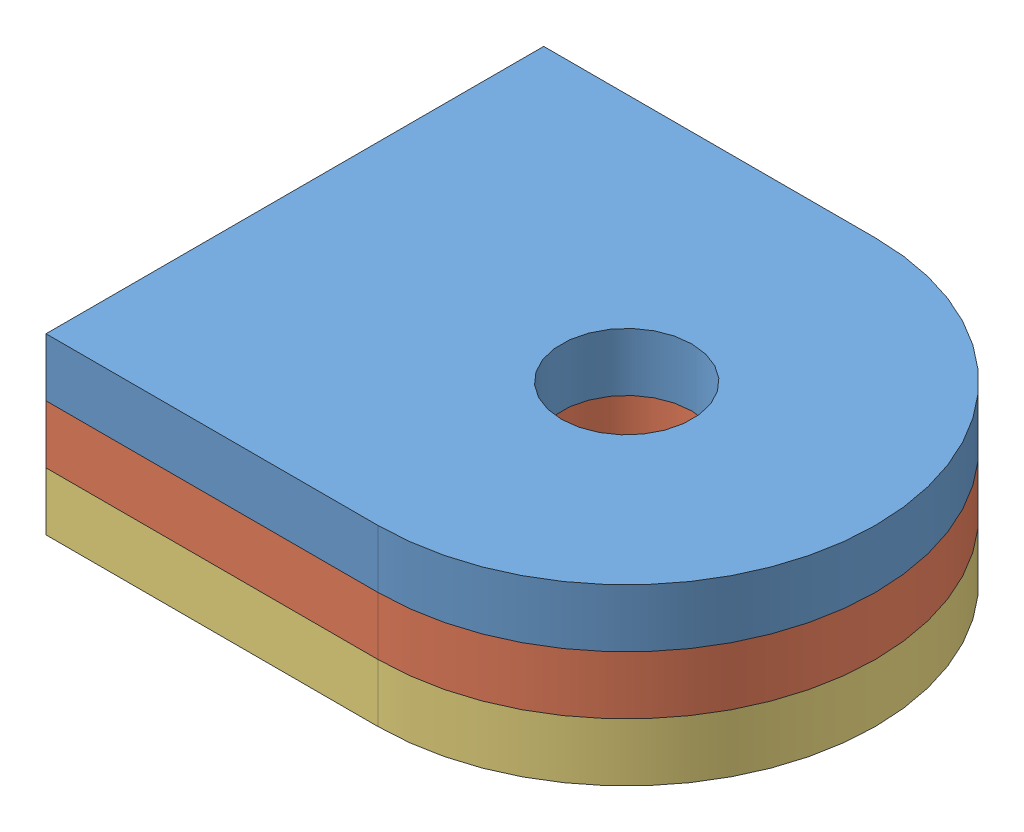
SolidWorks assembly Assembly Part Features.SLDASM, configuration Default (file format 4033). Lengths in mm.
Overall size (88.9 26.67 76.2).
3 component instances, 3 part files, 6 mates.
Components (placement in the parent):
- Part1-1: Part1.SLDPRT [Default] at origin size (88.9 8.89 76.2)
- Part2-1: Part2.SLDPRT [Default] at (0 -8.89 0) size (88.9 8.89 76.2)
- Part3-1: Part3.SLDPRT [Default] at (0 -17.78 0) size (88.9 8.89 76.2)
Mates (geometry in assembly coordinates):
- Coincident1: coincident aligned: plane of Part2-1 through (0 0 0) normal (-1 0 0); plane of Part3-1 through (0 -8.89 0) normal (-1 0 0)
- Coincident2: coincident aligned: plane of Part2-1 through (50.8 0 0) normal (0 0 1); plane of Part3-1 through (50.8 -8.89 0) normal (0 0 1)
- Coincident3: coincident aligned: plane of Part1-1 through (50.8 8.89 0) normal (0 0 1); plane of Part2-1 through (50.8 0 0) normal (0 0 1)
- Coincident4: coincident aligned: plane of Part1-1 through (0 8.89 0) normal (-1 0 0); plane of Part2-1 through (0 0 0) normal (-1 0 0)
- Coincident5: coincident anti-aligned: plane of Part1-1 through (50.8 0 -38.1) normal (0 -1 0); plane of Part2-1 through (50.8 0 -38.1) normal (0 1 0)
- Coincident6: coincident anti-aligned: plane of Part2-1 through (50.8 -8.89 -38.1) normal (0 -1 0); plane of Part3-1 through (50.8 -8.89 -38.1) normal (0 1 0); axis of Part1-1
